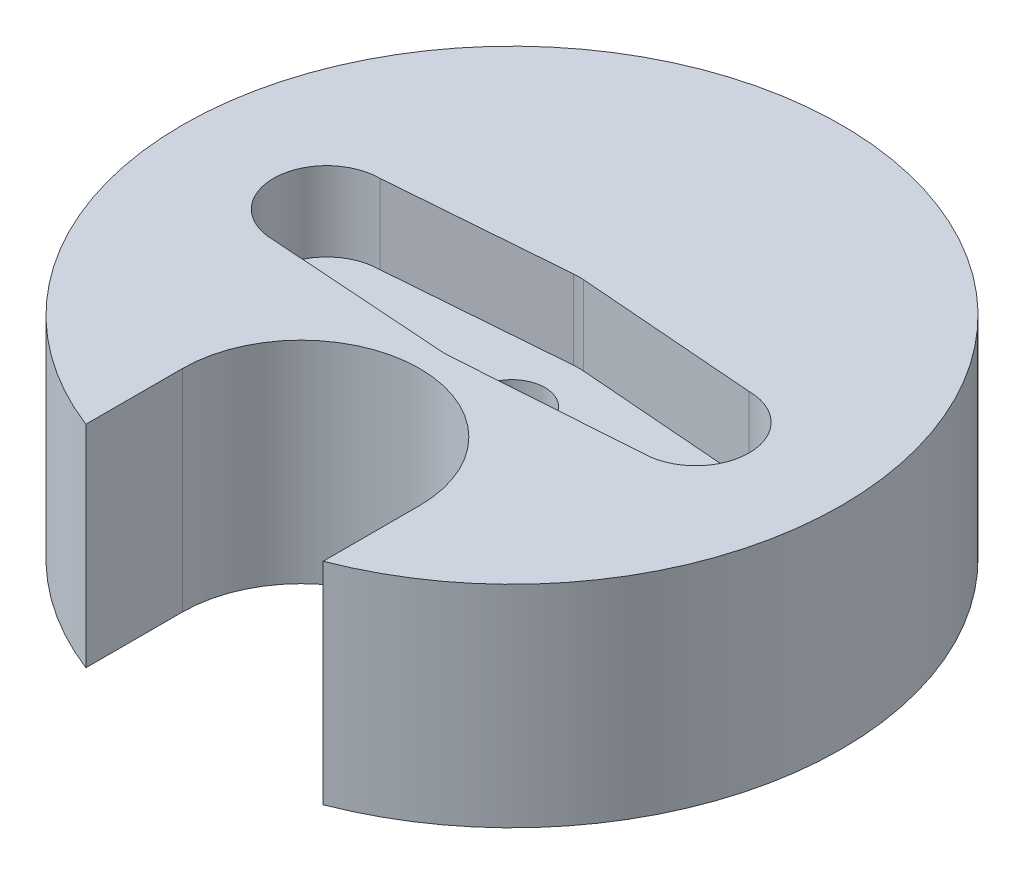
ISO-10303-21;
HEADER;
FILE_DESCRIPTION(('STEP AP214'),'2;1');
FILE_NAME('part.step','',(''),(''),'','','');
FILE_SCHEMA(('AUTOMOTIVE_DESIGN { 1 0 10303 214 1 1 1 1 }'));
ENDSEC;
DATA;
#1=APPLICATION_CONTEXT('core data for automotive mechanical design processes');
#2=APPLICATION_PROTOCOL_DEFINITION('international standard','automotive_design',2000,#1);
#3=PRODUCT_CONTEXT('',#1,'mechanical');
#4=PRODUCT('Part','Part','',(#3));
#5=PRODUCT_RELATED_PRODUCT_CATEGORY('part','',(#4));
#6=PRODUCT_DEFINITION_FORMATION('','',#4);
#7=PRODUCT_DEFINITION_CONTEXT('part definition',#1,'design');
#8=PRODUCT_DEFINITION('design','',#6,#7);
#9=PRODUCT_DEFINITION_SHAPE('','',#8);
#10=(LENGTH_UNIT() NAMED_UNIT(*) SI_UNIT(.MILLI.,.METRE.));
#11=(NAMED_UNIT(*) PLANE_ANGLE_UNIT() SI_UNIT($,.RADIAN.));
#12=(NAMED_UNIT(*) SI_UNIT($,.STERADIAN.) SOLID_ANGLE_UNIT());
#13=UNCERTAINTY_MEASURE_WITH_UNIT(LENGTH_MEASURE(1.E-05),#10,'distance_accuracy_value','');
#14=(GEOMETRIC_REPRESENTATION_CONTEXT(3) GLOBAL_UNCERTAINTY_ASSIGNED_CONTEXT((#13)) GLOBAL_UNIT_ASSIGNED_CONTEXT((#10,
#11,#12)) REPRESENTATION_CONTEXT('',''));
#15=CARTESIAN_POINT('',(0.,0.,0.));
#16=DIRECTION('',(0.,0.,1.));
#17=DIRECTION('',(1.,0.,0.));
#18=AXIS2_PLACEMENT_3D('',#15,#16,#17);
#19=CARTESIAN_POINT('',(0.,5.,8.));
#20=DIRECTION('',(0.,-1.,0.));
#21=DIRECTION('',(0.,0.,-1.));
#22=AXIS2_PLACEMENT_3D('',#19,#20,#21);
#23=CYLINDRICAL_SURFACE('',#22,4.5);
#24=CARTESIAN_POINT('',(0.,0.,8.));
#25=DIRECTION('',(0.,-1.,0.));
#26=DIRECTION('',(0.,0.,1.));
#27=AXIS2_PLACEMENT_3D('',#24,#25,#26);
#28=CIRCLE('',#27,4.5);
#29=CARTESIAN_POINT('',(-4.5,0.,8.));
#30=VERTEX_POINT('',#29);
#31=CARTESIAN_POINT('',(4.5,0.,8.));
#32=VERTEX_POINT('',#31);
#33=EDGE_CURVE('E234',#30,#32,#28,.T.);
#34=ORIENTED_EDGE('',*,*,#33,.T.);
#35=DIRECTION('',(0.,-1.,0.));
#36=VECTOR('',#35,1.);
#37=CARTESIAN_POINT('',(4.5,5.,8.));
#38=LINE('',#37,#36);
#39=CARTESIAN_POINT('',(4.5,8.,8.));
#40=VERTEX_POINT('',#39);
#41=EDGE_CURVE('E11',#40,#32,#38,.T.);
#42=ORIENTED_EDGE('',*,*,#41,.F.);
#43=CARTESIAN_POINT('',(0.,8.,8.));
#44=DIRECTION('',(0.,1.,0.));
#45=DIRECTION('',(0.,0.,1.));
#46=AXIS2_PLACEMENT_3D('',#43,#44,#45);
#47=CIRCLE('',#46,4.5);
#48=CARTESIAN_POINT('',(-4.5,8.,8.));
#49=VERTEX_POINT('',#48);
#50=EDGE_CURVE('E136',#49,#40,#47,.F.);
#51=ORIENTED_EDGE('',*,*,#50,.F.);
#52=DIRECTION('',(0.,-1.,0.));
#53=VECTOR('',#52,1.);
#54=CARTESIAN_POINT('',(-4.5,5.,8.));
#55=LINE('',#54,#53);
#56=EDGE_CURVE('E122',#49,#30,#55,.T.);
#57=ORIENTED_EDGE('',*,*,#56,.T.);
#58=EDGE_LOOP('',(#34,#42,#51,#57));
#59=FACE_BOUND('',#58,.T.);
#60=ADVANCED_FACE('F35',(#59),#23,.F.);
#61=CARTESIAN_POINT('',(4.5,5.,8.));
#62=DIRECTION('',(1.,0.,0.));
#63=DIRECTION('',(0.,0.,-1.));
#64=AXIS2_PLACEMENT_3D('',#61,#62,#63);
#65=PLANE('',#64);
#66=DIRECTION('',(0.,0.,1.));
#67=VECTOR('',#66,1.);
#68=CARTESIAN_POINT('',(4.5,0.,8.));
#69=LINE('',#68,#67);
#70=CARTESIAN_POINT('',(4.5,0.,11.6619037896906));
#71=VERTEX_POINT('',#70);
#72=EDGE_CURVE('E238',#32,#71,#69,.T.);
#73=ORIENTED_EDGE('',*,*,#72,.T.);
#74=DIRECTION('',(0.,-1.,0.));
#75=VECTOR('',#74,1.);
#76=CARTESIAN_POINT('',(4.5,5.,11.6619037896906));
#77=LINE('',#76,#75);
#78=CARTESIAN_POINT('',(4.5,8.,11.6619037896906));
#79=VERTEX_POINT('',#78);
#80=EDGE_CURVE('E42',#79,#71,#77,.T.);
#81=ORIENTED_EDGE('',*,*,#80,.F.);
#82=DIRECTION('',(0.,0.,1.));
#83=VECTOR('',#82,1.);
#84=CARTESIAN_POINT('',(4.5,8.,0.));
#85=LINE('',#84,#83);
#86=EDGE_CURVE('E140',#40,#79,#85,.T.);
#87=ORIENTED_EDGE('',*,*,#86,.F.);
#88=ORIENTED_EDGE('',*,*,#41,.T.);
#89=EDGE_LOOP('',(#73,#81,#87,#88));
#90=FACE_BOUND('',#89,.T.);
#91=ADVANCED_FACE('F250',(#90),#65,.F.);
#92=CARTESIAN_POINT('',(0.,5.,0.));
#93=DIRECTION('',(0.,-1.,0.));
#94=DIRECTION('',(0.,0.,-1.));
#95=AXIS2_PLACEMENT_3D('',#92,#93,#94);
#96=CYLINDRICAL_SURFACE('',#95,12.5);
#97=CARTESIAN_POINT('',(0.,0.,0.));
#98=DIRECTION('',(0.,1.,0.));
#99=DIRECTION('',(0.,0.,1.));
#100=AXIS2_PLACEMENT_3D('',#97,#98,#99);
#101=CIRCLE('',#100,12.5);
#102=CARTESIAN_POINT('',(-4.5,0.,11.6619037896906));
#103=VERTEX_POINT('',#102);
#104=EDGE_CURVE('E240',#71,#103,#101,.T.);
#105=ORIENTED_EDGE('',*,*,#104,.T.);
#106=DIRECTION('',(0.,-1.,0.));
#107=VECTOR('',#106,1.);
#108=CARTESIAN_POINT('',(-4.5,5.,11.6619037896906));
#109=LINE('',#108,#107);
#110=CARTESIAN_POINT('',(-4.5,8.,11.6619037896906));
#111=VERTEX_POINT('',#110);
#112=EDGE_CURVE('E133',#111,#103,#109,.T.);
#113=ORIENTED_EDGE('',*,*,#112,.F.);
#114=CARTESIAN_POINT('',(0.,8.,0.));
#115=DIRECTION('',(0.,1.,0.));
#116=DIRECTION('',(0.,0.,1.));
#117=AXIS2_PLACEMENT_3D('',#114,#115,#116);
#118=CIRCLE('',#117,12.5);
#119=EDGE_CURVE('E146',#79,#111,#118,.T.);
#120=ORIENTED_EDGE('',*,*,#119,.F.);
#121=ORIENTED_EDGE('',*,*,#80,.T.);
#122=EDGE_LOOP('',(#105,#113,#120,#121));
#123=FACE_BOUND('',#122,.T.);
#124=ADVANCED_FACE('F246',(#123),#96,.T.);
#125=CARTESIAN_POINT('',(-4.5,5.,8.));
#126=DIRECTION('',(-1.,0.,0.));
#127=DIRECTION('',(0.,0.,1.));
#128=AXIS2_PLACEMENT_3D('',#125,#126,#127);
#129=PLANE('',#128);
#130=DIRECTION('',(0.,0.,-1.));
#131=VECTOR('',#130,1.);
#132=CARTESIAN_POINT('',(-4.5,0.,8.));
#133=LINE('',#132,#131);
#134=EDGE_CURVE('E129',#103,#30,#133,.T.);
#135=ORIENTED_EDGE('',*,*,#134,.T.);
#136=ORIENTED_EDGE('',*,*,#56,.F.);
#137=DIRECTION('',(0.,0.,-1.));
#138=VECTOR('',#137,1.);
#139=CARTESIAN_POINT('',(-4.5,8.,0.));
#140=LINE('',#139,#138);
#141=EDGE_CURVE('E127',#111,#49,#140,.T.);
#142=ORIENTED_EDGE('',*,*,#141,.F.);
#143=ORIENTED_EDGE('',*,*,#112,.T.);
#144=EDGE_LOOP('',(#135,#136,#142,#143));
#145=FACE_BOUND('',#144,.T.);
#146=ADVANCED_FACE('F124',(#145),#129,.F.);
#147=CARTESIAN_POINT('',(0.,5.,8.));
#148=DIRECTION('',(0.,1.,0.));
#149=DIRECTION('',(0.,0.,1.));
#150=AXIS2_PLACEMENT_3D('',#147,#148,#149);
#151=PLANE('',#150);
#152=CARTESIAN_POINT('',(7.,5.,0.0302793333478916));
#153=DIRECTION('',(0.,1.,0.));
#154=DIRECTION('',(0.,0.,1.));
#155=AXIS2_PLACEMENT_3D('',#152,#153,#154);
#156=CIRCLE('',#155,2.02155675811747);
#157=CARTESIAN_POINT('',(7.,5.,-1.99127742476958));
#158=VERTEX_POINT('',#157);
#159=CARTESIAN_POINT('',(7.,5.,2.05183609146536));
#160=VERTEX_POINT('',#159);
#161=EDGE_CURVE('E177',#158,#160,#156,.F.);
#162=ORIENTED_EDGE('',*,*,#161,.F.);
#163=DIRECTION('',(-0.996955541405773,0.,-0.0779721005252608));
#164=VECTOR('',#163,1.);
#165=CARTESIAN_POINT('',(0.197348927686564,5.,-2.52331418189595));
#166=LINE('',#165,#164);
#167=CARTESIAN_POINT('',(0.197348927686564,5.,-2.52331418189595));
#168=VERTEX_POINT('',#167);
#169=EDGE_CURVE('E49',#158,#168,#166,.T.);
#170=ORIENTED_EDGE('',*,*,#169,.T.);
#171=CARTESIAN_POINT('',(0.,5.,0.));
#172=DIRECTION('',(0.,1.,0.));
#173=DIRECTION('',(0.,0.,1.));
#174=AXIS2_PLACEMENT_3D('',#171,#172,#173);
#175=CIRCLE('',#174,2.53101976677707);
#176=CARTESIAN_POINT('',(-0.197348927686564,5.,-2.52331418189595));
#177=VERTEX_POINT('',#176);
#178=EDGE_CURVE('E54',#168,#177,#175,.T.);
#179=ORIENTED_EDGE('',*,*,#178,.T.);
#180=DIRECTION('',(0.996955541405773,0.,-0.0779721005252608));
#181=VECTOR('',#180,1.);
#182=CARTESIAN_POINT('',(-0.197348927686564,5.,-2.52331418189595));
#183=LINE('',#182,#181);
#184=CARTESIAN_POINT('',(-7.,5.,-1.99127742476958));
#185=VERTEX_POINT('',#184);
#186=EDGE_CURVE('E148',#185,#177,#183,.T.);
#187=ORIENTED_EDGE('',*,*,#186,.F.);
#188=CARTESIAN_POINT('',(-7.,5.,0.0302793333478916));
#189=DIRECTION('',(0.,1.,0.));
#190=DIRECTION('',(0.,0.,1.));
#191=AXIS2_PLACEMENT_3D('',#188,#189,#190);
#192=CIRCLE('',#191,2.02155675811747);
#193=CARTESIAN_POINT('',(-7.,5.,2.05183609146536));
#194=VERTEX_POINT('',#193);
#195=EDGE_CURVE('E187',#185,#194,#192,.T.);
#196=ORIENTED_EDGE('',*,*,#195,.T.);
#197=DIRECTION('',(0.997605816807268,0.,0.0691565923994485));
#198=VECTOR('',#197,1.);
#199=CARTESIAN_POINT('',(-0.175036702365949,5.,2.52496004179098));
#200=LINE('',#199,#198);
#201=CARTESIAN_POINT('',(-0.175036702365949,5.,2.52496004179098));
#202=VERTEX_POINT('',#201);
#203=EDGE_CURVE('E185',#194,#202,#200,.T.);
#204=ORIENTED_EDGE('',*,*,#203,.T.);
#205=CARTESIAN_POINT('',(0.,5.,0.));
#206=DIRECTION('',(0.,1.,0.));
#207=DIRECTION('',(0.,0.,1.));
#208=AXIS2_PLACEMENT_3D('',#205,#206,#207);
#209=CIRCLE('',#208,2.53101976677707);
#210=CARTESIAN_POINT('',(0.17503670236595,5.,2.52496004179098));
#211=VERTEX_POINT('',#210);
#212=EDGE_CURVE('E183',#202,#211,#209,.T.);
#213=ORIENTED_EDGE('',*,*,#212,.T.);
#214=DIRECTION('',(-0.997605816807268,0.,0.0691565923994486));
#215=VECTOR('',#214,1.);
#216=CARTESIAN_POINT('',(0.175036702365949,5.,2.52496004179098));
#217=LINE('',#216,#215);
#218=EDGE_CURVE('E180',#160,#211,#217,.T.);
#219=ORIENTED_EDGE('',*,*,#218,.F.);
#220=EDGE_LOOP('',(#162,#170,#179,#187,#196,#204,#213,#219));
#221=FACE_BOUND('',#220,.T.);
#222=CARTESIAN_POINT('',(6.44999410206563,5.,-0.00872257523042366));
#223=DIRECTION('',(0.,1.,0.));
#224=DIRECTION('',(0.,0.,1.));
#225=AXIS2_PLACEMENT_3D('',#222,#223,#224);
#226=CIRCLE('',#225,0.600000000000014);
#227=CARTESIAN_POINT('',(6.44999410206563,5.,0.59127742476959));
#228=VERTEX_POINT('',#227);
#229=EDGE_CURVE('E217',#228,#228,#226,.T.);
#230=ORIENTED_EDGE('',*,*,#229,.F.);
#231=EDGE_LOOP('',(#230));
#232=FACE_BOUND('',#231,.T.);
#233=CARTESIAN_POINT('',(-6.44999410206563,5.,0.00872257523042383));
#234=DIRECTION('',(0.,1.,0.));
#235=DIRECTION('',(0.,0.,1.));
#236=AXIS2_PLACEMENT_3D('',#233,#234,#235);
#237=CIRCLE('',#236,0.600000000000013);
#238=CARTESIAN_POINT('',(-6.44999410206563,5.,0.608722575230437));
#239=VERTEX_POINT('',#238);
#240=EDGE_CURVE('E212',#239,#239,#237,.T.);
#241=ORIENTED_EDGE('',*,*,#240,.F.);
#242=EDGE_LOOP('',(#241));
#243=FACE_BOUND('',#242,.T.);
#244=CARTESIAN_POINT('',(0.,5.,0.));
#245=DIRECTION('',(0.,-1.,0.));
#246=DIRECTION('',(0.,0.,-1.));
#247=AXIS2_PLACEMENT_3D('',#244,#245,#246);
#248=CIRCLE('',#247,1.25);
#249=CARTESIAN_POINT('',(0.,5.,-1.25));
#250=VERTEX_POINT('',#249);
#251=EDGE_CURVE('E225',#250,#250,#248,.T.);
#252=ORIENTED_EDGE('',*,*,#251,.T.);
#253=EDGE_LOOP('',(#252));
#254=FACE_BOUND('',#253,.T.);
#255=ADVANCED_FACE('F260',(#221,#232,#243,#254),#151,.T.);
#256=CARTESIAN_POINT('',(0.,0.,8.));
#257=DIRECTION('',(0.,1.,0.));
#258=DIRECTION('',(0.,0.,1.));
#259=AXIS2_PLACEMENT_3D('',#256,#257,#258);
#260=PLANE('',#259);
#261=CARTESIAN_POINT('',(0.,0.,0.));
#262=DIRECTION('',(0.,1.,0.));
#263=DIRECTION('',(0.,0.,1.));
#264=AXIS2_PLACEMENT_3D('',#261,#262,#263);
#265=CIRCLE('',#264,2.5);
#266=CARTESIAN_POINT('',(0.,0.,2.5));
#267=VERTEX_POINT('',#266);
#268=EDGE_CURVE('E228',#267,#267,#265,.T.);
#269=ORIENTED_EDGE('',*,*,#268,.T.);
#270=EDGE_LOOP('',(#269));
#271=FACE_BOUND('',#270,.T.);
#272=ORIENTED_EDGE('',*,*,#33,.F.);
#273=ORIENTED_EDGE('',*,*,#134,.F.);
#274=ORIENTED_EDGE('',*,*,#104,.F.);
#275=ORIENTED_EDGE('',*,*,#72,.F.);
#276=EDGE_LOOP('',(#272,#273,#274,#275));
#277=FACE_BOUND('',#276,.T.);
#278=ADVANCED_FACE('F249',(#271,#277),#260,.F.);
#279=CARTESIAN_POINT('',(0.,2.5,0.));
#280=DIRECTION('',(0.,-1.,0.));
#281=DIRECTION('',(0.,0.,-1.));
#282=AXIS2_PLACEMENT_3D('',#279,#280,#281);
#283=CYLINDRICAL_SURFACE('',#282,2.5);
#284=CARTESIAN_POINT('',(0.,2.5,0.));
#285=DIRECTION('',(0.,1.,0.));
#286=DIRECTION('',(0.,0.,1.));
#287=AXIS2_PLACEMENT_3D('',#284,#285,#286);
#288=CIRCLE('',#287,2.5);
#289=CARTESIAN_POINT('',(0.,2.5,2.5));
#290=VERTEX_POINT('',#289);
#291=EDGE_CURVE('E231',#290,#290,#288,.T.);
#292=ORIENTED_EDGE('',*,*,#291,.T.);
#293=EDGE_LOOP('',(#292));
#294=FACE_BOUND('',#293,.T.);
#295=ORIENTED_EDGE('',*,*,#268,.F.);
#296=EDGE_LOOP('',(#295));
#297=FACE_BOUND('',#296,.T.);
#298=ADVANCED_FACE('F263',(#294,#297),#283,.F.);
#299=CARTESIAN_POINT('',(0.,2.5,0.));
#300=DIRECTION('',(0.,1.,0.));
#301=DIRECTION('',(0.,0.,1.));
#302=AXIS2_PLACEMENT_3D('',#299,#300,#301);
#303=PLANE('',#302);
#304=CARTESIAN_POINT('',(0.,2.5,0.));
#305=DIRECTION('',(0.,-1.,0.));
#306=DIRECTION('',(0.,0.,-1.));
#307=AXIS2_PLACEMENT_3D('',#304,#305,#306);
#308=CIRCLE('',#307,1.25);
#309=CARTESIAN_POINT('',(0.,2.5,-1.25));
#310=VERTEX_POINT('',#309);
#311=EDGE_CURVE('E216',#310,#310,#308,.T.);
#312=ORIENTED_EDGE('',*,*,#311,.F.);
#313=EDGE_LOOP('',(#312));
#314=FACE_BOUND('',#313,.T.);
#315=ORIENTED_EDGE('',*,*,#291,.F.);
#316=EDGE_LOOP('',(#315));
#317=FACE_BOUND('',#316,.T.);
#318=ADVANCED_FACE('F269',(#314,#317),#303,.F.);
#319=CARTESIAN_POINT('',(0.,5.,0.));
#320=DIRECTION('',(0.,-1.,0.));
#321=DIRECTION('',(0.,0.,-1.));
#322=AXIS2_PLACEMENT_3D('',#319,#320,#321);
#323=CYLINDRICAL_SURFACE('',#322,1.25);
#324=ORIENTED_EDGE('',*,*,#251,.F.);
#325=EDGE_LOOP('',(#324));
#326=FACE_BOUND('',#325,.T.);
#327=ORIENTED_EDGE('',*,*,#311,.T.);
#328=EDGE_LOOP('',(#327));
#329=FACE_BOUND('',#328,.T.);
#330=ADVANCED_FACE('F273',(#326,#329),#323,.F.);
#331=CARTESIAN_POINT('',(-6.44999410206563,2.5,0.00872257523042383));
#332=DIRECTION('',(0.,1.,0.));
#333=DIRECTION('',(0.,0.,1.));
#334=AXIS2_PLACEMENT_3D('',#331,#332,#333);
#335=CYLINDRICAL_SURFACE('',#334,0.600000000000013);
#336=CARTESIAN_POINT('',(-6.44999410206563,2.5,0.00872257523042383));
#337=DIRECTION('',(0.,1.,0.));
#338=DIRECTION('',(0.,0.,1.));
#339=AXIS2_PLACEMENT_3D('',#336,#337,#338);
#340=CIRCLE('',#339,0.600000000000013);
#341=CARTESIAN_POINT('',(-6.44999410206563,2.5,0.608722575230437));
#342=VERTEX_POINT('',#341);
#343=EDGE_CURVE('E220',#342,#342,#340,.T.);
#344=ORIENTED_EDGE('',*,*,#343,.F.);
#345=EDGE_LOOP('',(#344));
#346=FACE_BOUND('',#345,.T.);
#347=ORIENTED_EDGE('',*,*,#240,.T.);
#348=EDGE_LOOP('',(#347));
#349=FACE_BOUND('',#348,.T.);
#350=ADVANCED_FACE('F277',(#346,#349),#335,.F.);
#351=CARTESIAN_POINT('',(-6.44999410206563,2.5,0.00872257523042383));
#352=DIRECTION('',(0.,1.,0.));
#353=DIRECTION('',(0.,0.,1.));
#354=AXIS2_PLACEMENT_3D('',#351,#352,#353);
#355=PLANE('',#354);
#356=ORIENTED_EDGE('',*,*,#343,.T.);
#357=EDGE_LOOP('',(#356));
#358=FACE_BOUND('',#357,.T.);
#359=ADVANCED_FACE('F281',(#358),#355,.T.);
#360=CARTESIAN_POINT('',(6.44999410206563,2.5,-0.00872257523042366));
#361=DIRECTION('',(0.,1.,0.));
#362=DIRECTION('',(0.,0.,1.));
#363=AXIS2_PLACEMENT_3D('',#360,#361,#362);
#364=CYLINDRICAL_SURFACE('',#363,0.600000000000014);
#365=CARTESIAN_POINT('',(6.44999410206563,2.5,-0.00872257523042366));
#366=DIRECTION('',(0.,1.,0.));
#367=DIRECTION('',(0.,0.,1.));
#368=AXIS2_PLACEMENT_3D('',#365,#366,#367);
#369=CIRCLE('',#368,0.600000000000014);
#370=CARTESIAN_POINT('',(6.44999410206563,2.5,0.59127742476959));
#371=VERTEX_POINT('',#370);
#372=EDGE_CURVE('E213',#371,#371,#369,.T.);
#373=ORIENTED_EDGE('',*,*,#372,.F.);
#374=EDGE_LOOP('',(#373));
#375=FACE_BOUND('',#374,.T.);
#376=ORIENTED_EDGE('',*,*,#229,.T.);
#377=EDGE_LOOP('',(#376));
#378=FACE_BOUND('',#377,.T.);
#379=ADVANCED_FACE('F285',(#375,#378),#364,.F.);
#380=CARTESIAN_POINT('',(6.44999410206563,2.5,-0.00872257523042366));
#381=DIRECTION('',(0.,1.,0.));
#382=DIRECTION('',(0.,0.,1.));
#383=AXIS2_PLACEMENT_3D('',#380,#381,#382);
#384=PLANE('',#383);
#385=ORIENTED_EDGE('',*,*,#372,.T.);
#386=EDGE_LOOP('',(#385));
#387=FACE_BOUND('',#386,.T.);
#388=ADVANCED_FACE('F289',(#387),#384,.T.);
#389=CARTESIAN_POINT('',(0.197348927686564,8.,-2.52331418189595));
#390=DIRECTION('',(-0.0779721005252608,0.,0.996955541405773));
#391=DIRECTION('',(0.996955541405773,0.,0.0779721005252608));
#392=AXIS2_PLACEMENT_3D('',#389,#390,#391);
#393=PLANE('',#392);
#394=ORIENTED_EDGE('',*,*,#169,.F.);
#395=DIRECTION('',(0.,-1.,0.));
#396=VECTOR('',#395,1.);
#397=CARTESIAN_POINT('',(7.,8.,-1.99127742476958));
#398=LINE('',#397,#396);
#399=CARTESIAN_POINT('',(7.,8.,-1.99127742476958));
#400=VERTEX_POINT('',#399);
#401=EDGE_CURVE('E209',#400,#158,#398,.T.);
#402=ORIENTED_EDGE('',*,*,#401,.F.);
#403=DIRECTION('',(-0.996955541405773,0.,-0.0779721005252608));
#404=VECTOR('',#403,1.);
#405=CARTESIAN_POINT('',(0.197348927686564,8.,-2.52331418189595));
#406=LINE('',#405,#404);
#407=CARTESIAN_POINT('',(0.197348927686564,8.,-2.52331418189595));
#408=VERTEX_POINT('',#407);
#409=EDGE_CURVE('E153',#400,#408,#406,.T.);
#410=ORIENTED_EDGE('',*,*,#409,.T.);
#411=DIRECTION('',(0.,-1.,0.));
#412=VECTOR('',#411,1.);
#413=CARTESIAN_POINT('',(0.197348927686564,8.,-2.52331418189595));
#414=LINE('',#413,#412);
#415=EDGE_CURVE('E175',#408,#168,#414,.T.);
#416=ORIENTED_EDGE('',*,*,#415,.T.);
#417=EDGE_LOOP('',(#394,#402,#410,#416));
#418=FACE_BOUND('',#417,.T.);
#419=ADVANCED_FACE('F293',(#418),#393,.T.);
#420=CARTESIAN_POINT('',(7.,8.,0.0302793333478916));
#421=DIRECTION('',(0.,-1.,0.));
#422=DIRECTION('',(0.,0.,-1.));
#423=AXIS2_PLACEMENT_3D('',#420,#421,#422);
#424=CYLINDRICAL_SURFACE('',#423,2.02155675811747);
#425=ORIENTED_EDGE('',*,*,#161,.T.);
#426=DIRECTION('',(0.,-1.,0.));
#427=VECTOR('',#426,1.);
#428=CARTESIAN_POINT('',(7.,8.,2.05183609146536));
#429=LINE('',#428,#427);
#430=CARTESIAN_POINT('',(7.,8.,2.05183609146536));
#431=VERTEX_POINT('',#430);
#432=EDGE_CURVE('E206',#431,#160,#429,.T.);
#433=ORIENTED_EDGE('',*,*,#432,.F.);
#434=CARTESIAN_POINT('',(7.,8.,0.0302793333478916));
#435=DIRECTION('',(0.,1.,0.));
#436=DIRECTION('',(0.,0.,1.));
#437=AXIS2_PLACEMENT_3D('',#434,#435,#436);
#438=CIRCLE('',#437,2.02155675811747);
#439=EDGE_CURVE('E156',#400,#431,#438,.F.);
#440=ORIENTED_EDGE('',*,*,#439,.F.);
#441=ORIENTED_EDGE('',*,*,#401,.T.);
#442=EDGE_LOOP('',(#425,#433,#440,#441));
#443=FACE_BOUND('',#442,.T.);
#444=ADVANCED_FACE('F297',(#443),#424,.F.);
#445=CARTESIAN_POINT('',(0.175036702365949,8.,2.52496004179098));
#446=DIRECTION('',(0.0691565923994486,0.,0.997605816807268));
#447=DIRECTION('',(0.997605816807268,0.,-0.0691565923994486));
#448=AXIS2_PLACEMENT_3D('',#445,#446,#447);
#449=PLANE('',#448);
#450=ORIENTED_EDGE('',*,*,#218,.T.);
#451=DIRECTION('',(0.,-1.,0.));
#452=VECTOR('',#451,1.);
#453=CARTESIAN_POINT('',(0.17503670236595,8.,2.52496004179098));
#454=LINE('',#453,#452);
#455=CARTESIAN_POINT('',(0.17503670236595,8.,2.52496004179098));
#456=VERTEX_POINT('',#455);
#457=EDGE_CURVE('E203',#456,#211,#454,.T.);
#458=ORIENTED_EDGE('',*,*,#457,.F.);
#459=DIRECTION('',(-0.997605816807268,0.,0.0691565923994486));
#460=VECTOR('',#459,1.);
#461=CARTESIAN_POINT('',(0.175036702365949,8.,2.52496004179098));
#462=LINE('',#461,#460);
#463=EDGE_CURVE('E159',#431,#456,#462,.T.);
#464=ORIENTED_EDGE('',*,*,#463,.F.);
#465=ORIENTED_EDGE('',*,*,#432,.T.);
#466=EDGE_LOOP('',(#450,#458,#464,#465));
#467=FACE_BOUND('',#466,.T.);
#468=ADVANCED_FACE('F301',(#467),#449,.F.);
#469=CARTESIAN_POINT('',(0.,8.,0.));
#470=DIRECTION('',(0.,-1.,0.));
#471=DIRECTION('',(0.,0.,-1.));
#472=AXIS2_PLACEMENT_3D('',#469,#470,#471);
#473=CYLINDRICAL_SURFACE('',#472,2.53101976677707);
#474=ORIENTED_EDGE('',*,*,#212,.F.);
#475=DIRECTION('',(0.,-1.,0.));
#476=VECTOR('',#475,1.);
#477=CARTESIAN_POINT('',(-0.175036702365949,8.,2.52496004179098));
#478=LINE('',#477,#476);
#479=CARTESIAN_POINT('',(-0.175036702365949,8.,2.52496004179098));
#480=VERTEX_POINT('',#479);
#481=EDGE_CURVE('E200',#480,#202,#478,.T.);
#482=ORIENTED_EDGE('',*,*,#481,.F.);
#483=CARTESIAN_POINT('',(0.,8.,0.));
#484=DIRECTION('',(0.,1.,0.));
#485=DIRECTION('',(0.,0.,1.));
#486=AXIS2_PLACEMENT_3D('',#483,#484,#485);
#487=CIRCLE('',#486,2.53101976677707);
#488=EDGE_CURVE('E161',#480,#456,#487,.T.);
#489=ORIENTED_EDGE('',*,*,#488,.T.);
#490=ORIENTED_EDGE('',*,*,#457,.T.);
#491=EDGE_LOOP('',(#474,#482,#489,#490));
#492=FACE_BOUND('',#491,.T.);
#493=ADVANCED_FACE('F305',(#492),#473,.F.);
#494=CARTESIAN_POINT('',(-0.175036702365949,8.,2.52496004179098));
#495=DIRECTION('',(0.0691565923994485,0.,-0.997605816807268));
#496=DIRECTION('',(-0.997605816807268,0.,-0.0691565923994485));
#497=AXIS2_PLACEMENT_3D('',#494,#495,#496);
#498=PLANE('',#497);
#499=ORIENTED_EDGE('',*,*,#203,.F.);
#500=DIRECTION('',(0.,-1.,0.));
#501=VECTOR('',#500,1.);
#502=CARTESIAN_POINT('',(-7.,8.,2.05183609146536));
#503=LINE('',#502,#501);
#504=CARTESIAN_POINT('',(-7.,8.,2.05183609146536));
#505=VERTEX_POINT('',#504);
#506=EDGE_CURVE('E197',#505,#194,#503,.T.);
#507=ORIENTED_EDGE('',*,*,#506,.F.);
#508=DIRECTION('',(0.997605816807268,0.,0.0691565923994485));
#509=VECTOR('',#508,1.);
#510=CARTESIAN_POINT('',(-0.175036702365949,8.,2.52496004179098));
#511=LINE('',#510,#509);
#512=EDGE_CURVE('E164',#505,#480,#511,.T.);
#513=ORIENTED_EDGE('',*,*,#512,.T.);
#514=ORIENTED_EDGE('',*,*,#481,.T.);
#515=EDGE_LOOP('',(#499,#507,#513,#514));
#516=FACE_BOUND('',#515,.T.);
#517=ADVANCED_FACE('F309',(#516),#498,.T.);
#518=CARTESIAN_POINT('',(-7.,8.,0.0302793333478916));
#519=DIRECTION('',(0.,-1.,0.));
#520=DIRECTION('',(0.,0.,-1.));
#521=AXIS2_PLACEMENT_3D('',#518,#519,#520);
#522=CYLINDRICAL_SURFACE('',#521,2.02155675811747);
#523=ORIENTED_EDGE('',*,*,#195,.F.);
#524=DIRECTION('',(0.,-1.,0.));
#525=VECTOR('',#524,1.);
#526=CARTESIAN_POINT('',(-7.,8.,-1.99127742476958));
#527=LINE('',#526,#525);
#528=CARTESIAN_POINT('',(-7.,8.,-1.99127742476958));
#529=VERTEX_POINT('',#528);
#530=EDGE_CURVE('E194',#529,#185,#527,.T.);
#531=ORIENTED_EDGE('',*,*,#530,.F.);
#532=CARTESIAN_POINT('',(-7.,8.,0.0302793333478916));
#533=DIRECTION('',(0.,1.,0.));
#534=DIRECTION('',(0.,0.,1.));
#535=AXIS2_PLACEMENT_3D('',#532,#533,#534);
#536=CIRCLE('',#535,2.02155675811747);
#537=EDGE_CURVE('E167',#529,#505,#536,.T.);
#538=ORIENTED_EDGE('',*,*,#537,.T.);
#539=ORIENTED_EDGE('',*,*,#506,.T.);
#540=EDGE_LOOP('',(#523,#531,#538,#539));
#541=FACE_BOUND('',#540,.T.);
#542=ADVANCED_FACE('F313',(#541),#522,.F.);
#543=CARTESIAN_POINT('',(-0.197348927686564,8.,-2.52331418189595));
#544=DIRECTION('',(-0.0779721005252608,0.,-0.996955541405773));
#545=DIRECTION('',(-0.996955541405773,0.,0.0779721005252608));
#546=AXIS2_PLACEMENT_3D('',#543,#544,#545);
#547=PLANE('',#546);
#548=ORIENTED_EDGE('',*,*,#186,.T.);
#549=DIRECTION('',(0.,-1.,0.));
#550=VECTOR('',#549,1.);
#551=CARTESIAN_POINT('',(-0.197348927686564,8.,-2.52331418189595));
#552=LINE('',#551,#550);
#553=CARTESIAN_POINT('',(-0.197348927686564,8.,-2.52331418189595));
#554=VERTEX_POINT('',#553);
#555=EDGE_CURVE('E192',#554,#177,#552,.T.);
#556=ORIENTED_EDGE('',*,*,#555,.F.);
#557=DIRECTION('',(0.996955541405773,0.,-0.0779721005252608));
#558=VECTOR('',#557,1.);
#559=CARTESIAN_POINT('',(-0.197348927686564,8.,-2.52331418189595));
#560=LINE('',#559,#558);
#561=EDGE_CURVE('E170',#529,#554,#560,.T.);
#562=ORIENTED_EDGE('',*,*,#561,.F.);
#563=ORIENTED_EDGE('',*,*,#530,.T.);
#564=EDGE_LOOP('',(#548,#556,#562,#563));
#565=FACE_BOUND('',#564,.T.);
#566=ADVANCED_FACE('F317',(#565),#547,.F.);
#567=CARTESIAN_POINT('',(0.,8.,0.));
#568=DIRECTION('',(0.,-1.,0.));
#569=DIRECTION('',(0.,0.,-1.));
#570=AXIS2_PLACEMENT_3D('',#567,#568,#569);
#571=CYLINDRICAL_SURFACE('',#570,2.53101976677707);
#572=ORIENTED_EDGE('',*,*,#178,.F.);
#573=ORIENTED_EDGE('',*,*,#415,.F.);
#574=CARTESIAN_POINT('',(0.,8.,0.));
#575=DIRECTION('',(0.,1.,0.));
#576=DIRECTION('',(0.,0.,1.));
#577=AXIS2_PLACEMENT_3D('',#574,#575,#576);
#578=CIRCLE('',#577,2.53101976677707);
#579=EDGE_CURVE('E172',#408,#554,#578,.T.);
#580=ORIENTED_EDGE('',*,*,#579,.T.);
#581=ORIENTED_EDGE('',*,*,#555,.T.);
#582=EDGE_LOOP('',(#572,#573,#580,#581));
#583=FACE_BOUND('',#582,.T.);
#584=ADVANCED_FACE('F321',(#583),#571,.F.);
#585=CARTESIAN_POINT('',(0.,8.,0.));
#586=DIRECTION('',(0.,1.,0.));
#587=DIRECTION('',(0.,0.,1.));
#588=AXIS2_PLACEMENT_3D('',#585,#586,#587);
#589=PLANE('',#588);
#590=ORIENTED_EDGE('',*,*,#141,.T.);
#591=ORIENTED_EDGE('',*,*,#50,.T.);
#592=ORIENTED_EDGE('',*,*,#86,.T.);
#593=ORIENTED_EDGE('',*,*,#119,.T.);
#594=EDGE_LOOP('',(#590,#591,#592,#593));
#595=FACE_BOUND('',#594,.T.);
#596=ORIENTED_EDGE('',*,*,#409,.F.);
#597=ORIENTED_EDGE('',*,*,#439,.T.);
#598=ORIENTED_EDGE('',*,*,#463,.T.);
#599=ORIENTED_EDGE('',*,*,#488,.F.);
#600=ORIENTED_EDGE('',*,*,#512,.F.);
#601=ORIENTED_EDGE('',*,*,#537,.F.);
#602=ORIENTED_EDGE('',*,*,#561,.T.);
#603=ORIENTED_EDGE('',*,*,#579,.F.);
#604=EDGE_LOOP('',(#596,#597,#598,#599,#600,#601,#602,#603));
#605=FACE_BOUND('',#604,.T.);
#606=ADVANCED_FACE('F143',(#595,#605),#589,.T.);
#607=CLOSED_SHELL('',(#60,#91,#124,#146,#255,#278,#298,#318,#330,#350,#359,#379,#388,#419,#444,
#468,#493,#517,#542,#566,#584,#606));
#608=MANIFOLD_SOLID_BREP('B2',#607);
#609=ADVANCED_BREP_SHAPE_REPRESENTATION('',(#18,#608),#14);
#610=SHAPE_DEFINITION_REPRESENTATION(#9,#609);
ENDSEC;
END-ISO-10303-21;
